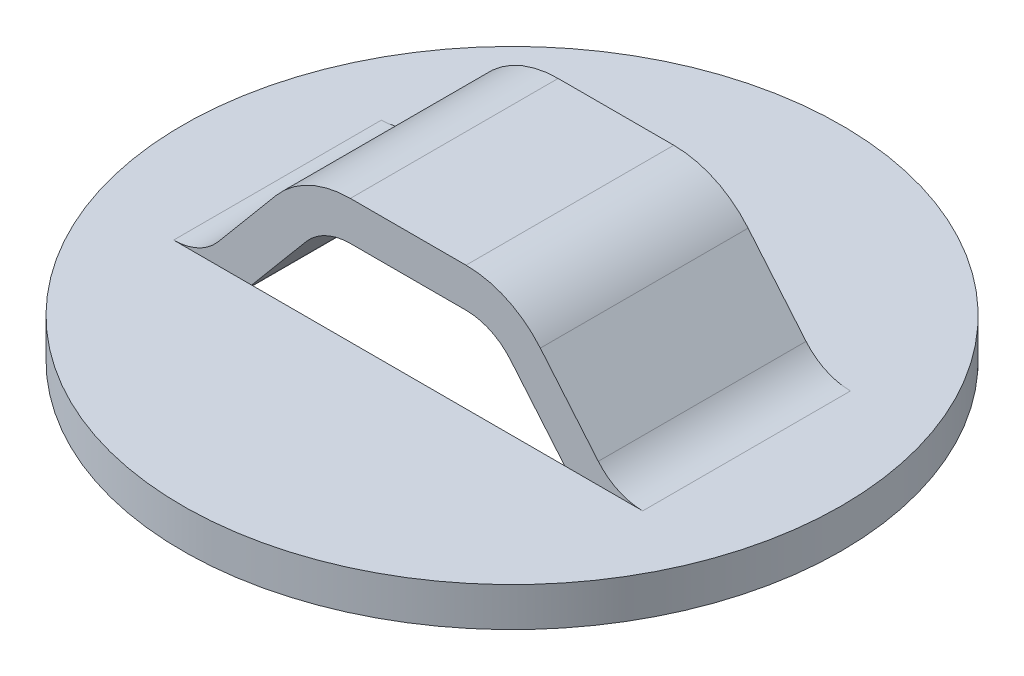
ISO-10303-21;
HEADER;
FILE_DESCRIPTION(('STEP AP214'),'2;1');
FILE_NAME('part.step','',(''),(''),'','','');
FILE_SCHEMA(('AUTOMOTIVE_DESIGN { 1 0 10303 214 1 1 1 1 }'));
ENDSEC;
DATA;
#1=APPLICATION_CONTEXT('core data for automotive mechanical design processes');
#2=APPLICATION_PROTOCOL_DEFINITION('international standard','automotive_design',2000,#1);
#3=PRODUCT_CONTEXT('',#1,'mechanical');
#4=PRODUCT('Part','Part','',(#3));
#5=PRODUCT_RELATED_PRODUCT_CATEGORY('part','',(#4));
#6=PRODUCT_DEFINITION_FORMATION('','',#4);
#7=PRODUCT_DEFINITION_CONTEXT('part definition',#1,'design');
#8=PRODUCT_DEFINITION('design','',#6,#7);
#9=PRODUCT_DEFINITION_SHAPE('','',#8);
#10=(LENGTH_UNIT() NAMED_UNIT(*) SI_UNIT(.MILLI.,.METRE.));
#11=(NAMED_UNIT(*) PLANE_ANGLE_UNIT() SI_UNIT($,.RADIAN.));
#12=(NAMED_UNIT(*) SI_UNIT($,.STERADIAN.) SOLID_ANGLE_UNIT());
#13=UNCERTAINTY_MEASURE_WITH_UNIT(LENGTH_MEASURE(1.E-05),#10,'distance_accuracy_value','');
#14=(GEOMETRIC_REPRESENTATION_CONTEXT(3) GLOBAL_UNCERTAINTY_ASSIGNED_CONTEXT((#13)) GLOBAL_UNIT_ASSIGNED_CONTEXT((#10,
#11,#12)) REPRESENTATION_CONTEXT('',''));
#15=CARTESIAN_POINT('',(0.,0.,0.));
#16=DIRECTION('',(0.,0.,1.));
#17=DIRECTION('',(1.,0.,0.));
#18=AXIS2_PLACEMENT_3D('',#15,#16,#17);
#19=CARTESIAN_POINT('',(-11.2977635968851,2.794,0.));
#20=DIRECTION('',(0.,0.,-1.));
#21=DIRECTION('',(-1.,0.,0.));
#22=AXIS2_PLACEMENT_3D('',#19,#20,#21);
#23=PLANE('',#22);
#24=DIRECTION('',(-1.,0.,0.));
#25=VECTOR('',#24,1.);
#26=CARTESIAN_POINT('',(-11.2977635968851,0.,0.));
#27=LINE('',#26,#25);
#28=CARTESIAN_POINT('',(11.2977635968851,0.,0.));
#29=VERTEX_POINT('',#28);
#30=CARTESIAN_POINT('',(7.54125645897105,0.,0.));
#31=VERTEX_POINT('',#30);
#32=EDGE_CURVE('E53',#29,#31,#27,.T.);
#33=ORIENTED_EDGE('',*,*,#32,.F.);
#34=CARTESIAN_POINT('',(11.2977635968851,2.794,0.));
#35=DIRECTION('',(0.,0.,1.));
#36=DIRECTION('',(1.,0.,0.));
#37=AXIS2_PLACEMENT_3D('',#34,#35,#36);
#38=CIRCLE('',#37,2.794);
#39=CARTESIAN_POINT('',(9.15743542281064,0.998051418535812,0.));
#40=VERTEX_POINT('',#39);
#41=EDGE_CURVE('E165',#29,#40,#38,.F.);
#42=ORIENTED_EDGE('',*,*,#41,.T.);
#43=DIRECTION('',(-0.642787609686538,0.76604444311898,0.));
#44=VECTOR('',#43,1.);
#45=CARTESIAN_POINT('',(6.36585100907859,4.324932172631,0.));
#46=LINE('',#45,#44);
#47=CARTESIAN_POINT('',(6.36585100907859,4.324932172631,0.));
#48=VERTEX_POINT('',#47);
#49=EDGE_CURVE('E196',#48,#40,#46,.F.);
#50=ORIENTED_EDGE('',*,*,#49,.F.);
#51=CARTESIAN_POINT('',(2.78566569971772,1.3208,0.));
#52=DIRECTION('',(0.,0.,1.));
#53=DIRECTION('',(1.,0.,0.));
#54=AXIS2_PLACEMENT_3D('',#51,#52,#53);
#55=CIRCLE('',#54,4.6736);
#56=CARTESIAN_POINT('',(2.78566569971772,5.9944,0.));
#57=VERTEX_POINT('',#56);
#58=EDGE_CURVE('E200',#57,#48,#55,.F.);
#59=ORIENTED_EDGE('',*,*,#58,.F.);
#60=DIRECTION('',(1.,0.,0.));
#61=VECTOR('',#60,1.);
#62=CARTESIAN_POINT('',(-2.78566569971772,5.9944,0.));
#63=LINE('',#62,#61);
#64=CARTESIAN_POINT('',(-2.78566569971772,5.9944,0.));
#65=VERTEX_POINT('',#64);
#66=EDGE_CURVE('E204',#65,#57,#63,.T.);
#67=ORIENTED_EDGE('',*,*,#66,.F.);
#68=CARTESIAN_POINT('',(-2.78566569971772,1.3208,0.));
#69=DIRECTION('',(0.,0.,1.));
#70=DIRECTION('',(1.,0.,0.));
#71=AXIS2_PLACEMENT_3D('',#68,#69,#70);
#72=CIRCLE('',#71,4.6736);
#73=CARTESIAN_POINT('',(-6.36585100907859,4.324932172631,0.));
#74=VERTEX_POINT('',#73);
#75=EDGE_CURVE('E208',#74,#65,#72,.F.);
#76=ORIENTED_EDGE('',*,*,#75,.F.);
#77=DIRECTION('',(-0.642787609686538,-0.76604444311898,0.));
#78=VECTOR('',#77,1.);
#79=CARTESIAN_POINT('',(-9.15743542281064,0.998051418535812,0.));
#80=LINE('',#79,#78);
#81=CARTESIAN_POINT('',(-9.15743542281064,0.998051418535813,0.));
#82=VERTEX_POINT('',#81);
#83=EDGE_CURVE('E212',#82,#74,#80,.F.);
#84=ORIENTED_EDGE('',*,*,#83,.F.);
#85=CARTESIAN_POINT('',(-11.2977635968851,2.794,0.));
#86=DIRECTION('',(0.,0.,1.));
#87=DIRECTION('',(1.,0.,0.));
#88=AXIS2_PLACEMENT_3D('',#85,#86,#87);
#89=CIRCLE('',#88,2.794);
#90=CARTESIAN_POINT('',(-11.2977635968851,0.,0.));
#91=VERTEX_POINT('',#90);
#92=EDGE_CURVE('E216',#82,#91,#89,.F.);
#93=ORIENTED_EDGE('',*,*,#92,.T.);
#94=CARTESIAN_POINT('',(-7.54125645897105,0.,0.));
#95=VERTEX_POINT('',#94);
#96=EDGE_CURVE('E173',#95,#91,#27,.T.);
#97=ORIENTED_EDGE('',*,*,#96,.F.);
#98=DIRECTION('',(0.642787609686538,0.766044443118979,0.));
#99=VECTOR('',#98,1.);
#100=CARTESIAN_POINT('',(-7.71757828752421,-0.210132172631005,0.));
#101=LINE('',#100,#99);
#102=CARTESIAN_POINT('',(-4.92599387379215,3.11674858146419,0.));
#103=VERTEX_POINT('',#102);
#104=EDGE_CURVE('E218',#103,#95,#101,.F.);
#105=ORIENTED_EDGE('',*,*,#104,.F.);
#106=CARTESIAN_POINT('',(-2.78566569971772,1.3208,0.));
#107=DIRECTION('',(0.,0.,1.));
#108=DIRECTION('',(1.,0.,0.));
#109=AXIS2_PLACEMENT_3D('',#106,#107,#108);
#110=CIRCLE('',#109,2.794);
#111=CARTESIAN_POINT('',(-2.78566569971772,4.1148,0.));
#112=VERTEX_POINT('',#111);
#113=EDGE_CURVE('E222',#103,#112,#110,.F.);
#114=ORIENTED_EDGE('',*,*,#113,.T.);
#115=DIRECTION('',(1.,0.,0.));
#116=VECTOR('',#115,1.);
#117=CARTESIAN_POINT('',(-2.78566569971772,4.1148,0.));
#118=LINE('',#117,#116);
#119=CARTESIAN_POINT('',(2.78566569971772,4.1148,0.));
#120=VERTEX_POINT('',#119);
#121=EDGE_CURVE('E223',#120,#112,#118,.F.);
#122=ORIENTED_EDGE('',*,*,#121,.F.);
#123=CARTESIAN_POINT('',(2.78566569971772,1.3208,0.));
#124=DIRECTION('',(0.,0.,1.));
#125=DIRECTION('',(1.,0.,0.));
#126=AXIS2_PLACEMENT_3D('',#123,#124,#125);
#127=CIRCLE('',#126,2.794);
#128=CARTESIAN_POINT('',(4.92599387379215,3.11674858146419,0.));
#129=VERTEX_POINT('',#128);
#130=EDGE_CURVE('E226',#120,#129,#127,.F.);
#131=ORIENTED_EDGE('',*,*,#130,.T.);
#132=DIRECTION('',(0.642787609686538,-0.766044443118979,0.));
#133=VECTOR('',#132,1.);
#134=CARTESIAN_POINT('',(4.92599387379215,3.11674858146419,0.));
#135=LINE('',#134,#133);
#136=EDGE_CURVE('E168',#31,#129,#135,.F.);
#137=ORIENTED_EDGE('',*,*,#136,.F.);
#138=EDGE_LOOP('',(#33,#42,#50,#59,#67,#76,#84,#93,#97,#105,#114,#122,#131,#137));
#139=FACE_BOUND('',#138,.T.);
#140=ADVANCED_FACE('F39',(#139),#23,.F.);
#141=CARTESIAN_POINT('',(-11.2977635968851,2.794,-10.0076));
#142=DIRECTION('',(0.,0.,-1.));
#143=DIRECTION('',(-1.,0.,0.));
#144=AXIS2_PLACEMENT_3D('',#141,#142,#143);
#145=PLANE('',#144);
#146=CARTESIAN_POINT('',(11.2977635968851,2.794,-10.0076));
#147=DIRECTION('',(0.,0.,1.));
#148=DIRECTION('',(1.,0.,0.));
#149=AXIS2_PLACEMENT_3D('',#146,#147,#148);
#150=CIRCLE('',#149,2.794);
#151=CARTESIAN_POINT('',(9.15743542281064,0.998051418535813,-10.0076));
#152=VERTEX_POINT('',#151);
#153=CARTESIAN_POINT('',(11.2977635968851,0.,-10.0076));
#154=VERTEX_POINT('',#153);
#155=EDGE_CURVE('E250',#152,#154,#150,.T.);
#156=ORIENTED_EDGE('',*,*,#155,.T.);
#157=DIRECTION('',(-1.,0.,0.));
#158=VECTOR('',#157,1.);
#159=CARTESIAN_POINT('',(-11.2977635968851,0.,-10.0076));
#160=LINE('',#159,#158);
#161=CARTESIAN_POINT('',(7.54125645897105,0.,-10.0076));
#162=VERTEX_POINT('',#161);
#163=EDGE_CURVE('E11',#154,#162,#160,.T.);
#164=ORIENTED_EDGE('',*,*,#163,.T.);
#165=DIRECTION('',(-0.642787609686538,0.766044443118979,0.));
#166=VECTOR('',#165,1.);
#167=CARTESIAN_POINT('',(7.7175782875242,-0.210132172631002,-10.0076));
#168=LINE('',#167,#166);
#169=CARTESIAN_POINT('',(4.92599387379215,3.11674858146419,-10.0076));
#170=VERTEX_POINT('',#169);
#171=EDGE_CURVE('E249',#162,#170,#168,.T.);
#172=ORIENTED_EDGE('',*,*,#171,.T.);
#173=CARTESIAN_POINT('',(2.78566569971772,1.3208,-10.0076));
#174=DIRECTION('',(0.,0.,1.));
#175=DIRECTION('',(1.,0.,0.));
#176=AXIS2_PLACEMENT_3D('',#173,#174,#175);
#177=CIRCLE('',#176,2.794);
#178=CARTESIAN_POINT('',(2.78566569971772,4.1148,-10.0076));
#179=VERTEX_POINT('',#178);
#180=EDGE_CURVE('E242',#170,#179,#177,.T.);
#181=ORIENTED_EDGE('',*,*,#180,.T.);
#182=DIRECTION('',(-1.,0.,0.));
#183=VECTOR('',#182,1.);
#184=CARTESIAN_POINT('',(-11.2977635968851,4.1148,-10.0076));
#185=LINE('',#184,#183);
#186=CARTESIAN_POINT('',(-2.78566569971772,4.1148,-10.0076));
#187=VERTEX_POINT('',#186);
#188=EDGE_CURVE('E241',#179,#187,#185,.T.);
#189=ORIENTED_EDGE('',*,*,#188,.T.);
#190=CARTESIAN_POINT('',(-2.78566569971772,1.3208,-10.0076));
#191=DIRECTION('',(0.,0.,1.));
#192=DIRECTION('',(1.,0.,0.));
#193=AXIS2_PLACEMENT_3D('',#190,#191,#192);
#194=CIRCLE('',#193,2.794);
#195=CARTESIAN_POINT('',(-4.92599387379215,3.11674858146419,-10.0076));
#196=VERTEX_POINT('',#195);
#197=EDGE_CURVE('E238',#187,#196,#194,.T.);
#198=ORIENTED_EDGE('',*,*,#197,.T.);
#199=DIRECTION('',(-0.642787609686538,-0.766044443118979,0.));
#200=VECTOR('',#199,1.);
#201=CARTESIAN_POINT('',(-4.92599387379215,3.11674858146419,-10.0076));
#202=LINE('',#201,#200);
#203=CARTESIAN_POINT('',(-7.54125645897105,0.,-10.0076));
#204=VERTEX_POINT('',#203);
#205=EDGE_CURVE('E237',#196,#204,#202,.T.);
#206=ORIENTED_EDGE('',*,*,#205,.T.);
#207=DIRECTION('',(1.,0.,0.));
#208=VECTOR('',#207,1.);
#209=CARTESIAN_POINT('',(-11.2977635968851,0.,-10.0076));
#210=LINE('',#209,#208);
#211=CARTESIAN_POINT('',(-11.2977635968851,0.,-10.0076));
#212=VERTEX_POINT('',#211);
#213=EDGE_CURVE('E285',#212,#204,#210,.T.);
#214=ORIENTED_EDGE('',*,*,#213,.F.);
#215=CARTESIAN_POINT('',(-11.2977635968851,2.794,-10.0076));
#216=DIRECTION('',(0.,0.,1.));
#217=DIRECTION('',(1.,0.,0.));
#218=AXIS2_PLACEMENT_3D('',#215,#216,#217);
#219=CIRCLE('',#218,2.794);
#220=CARTESIAN_POINT('',(-9.15743542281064,0.998051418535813,-10.0076));
#221=VERTEX_POINT('',#220);
#222=EDGE_CURVE('E261',#212,#221,#219,.T.);
#223=ORIENTED_EDGE('',*,*,#222,.T.);
#224=DIRECTION('',(0.642787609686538,0.766044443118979,0.));
#225=VECTOR('',#224,1.);
#226=CARTESIAN_POINT('',(-9.15743542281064,0.998051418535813,-10.0076));
#227=LINE('',#226,#225);
#228=CARTESIAN_POINT('',(-6.36585100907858,4.324932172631,-10.0076));
#229=VERTEX_POINT('',#228);
#230=EDGE_CURVE('E260',#221,#229,#227,.T.);
#231=ORIENTED_EDGE('',*,*,#230,.T.);
#232=CARTESIAN_POINT('',(-2.78566569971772,1.3208,-10.0076));
#233=DIRECTION('',(0.,0.,1.));
#234=DIRECTION('',(1.,0.,0.));
#235=AXIS2_PLACEMENT_3D('',#232,#233,#234);
#236=CIRCLE('',#235,4.6736);
#237=CARTESIAN_POINT('',(-2.78566569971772,5.9944,-10.0076));
#238=VERTEX_POINT('',#237);
#239=EDGE_CURVE('E257',#229,#238,#236,.F.);
#240=ORIENTED_EDGE('',*,*,#239,.T.);
#241=DIRECTION('',(-1.,0.,0.));
#242=VECTOR('',#241,1.);
#243=CARTESIAN_POINT('',(-11.2977635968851,5.9944,-10.0076));
#244=LINE('',#243,#242);
#245=CARTESIAN_POINT('',(2.78566569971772,5.9944,-10.0076));
#246=VERTEX_POINT('',#245);
#247=EDGE_CURVE('E256',#238,#246,#244,.F.);
#248=ORIENTED_EDGE('',*,*,#247,.T.);
#249=CARTESIAN_POINT('',(2.78566569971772,1.3208,-10.0076));
#250=DIRECTION('',(0.,0.,1.));
#251=DIRECTION('',(1.,0.,0.));
#252=AXIS2_PLACEMENT_3D('',#249,#250,#251);
#253=CIRCLE('',#252,4.6736);
#254=CARTESIAN_POINT('',(6.36585100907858,4.324932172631,-10.0076));
#255=VERTEX_POINT('',#254);
#256=EDGE_CURVE('E253',#246,#255,#253,.F.);
#257=ORIENTED_EDGE('',*,*,#256,.T.);
#258=DIRECTION('',(0.642787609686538,-0.766044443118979,0.));
#259=VECTOR('',#258,1.);
#260=CARTESIAN_POINT('',(6.36585100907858,4.324932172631,-10.0076));
#261=LINE('',#260,#259);
#262=EDGE_CURVE('E252',#255,#152,#261,.T.);
#263=ORIENTED_EDGE('',*,*,#262,.T.);
#264=EDGE_LOOP('',(#156,#164,#172,#181,#189,#198,#206,#214,#223,#231,#240,#248,#257,#263));
#265=FACE_BOUND('',#264,.T.);
#266=ADVANCED_FACE('F355',(#265),#145,.T.);
#267=CARTESIAN_POINT('',(-11.2977635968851,2.794,-10.0076));
#268=DIRECTION('',(0.,0.,1.));
#269=DIRECTION('',(1.,0.,0.));
#270=AXIS2_PLACEMENT_3D('',#267,#268,#269);
#271=CYLINDRICAL_SURFACE('',#270,2.794);
#272=DIRECTION('',(0.,0.,1.));
#273=VECTOR('',#272,1.);
#274=CARTESIAN_POINT('',(-9.15743542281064,0.998051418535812,-10.0076));
#275=LINE('',#274,#273);
#276=EDGE_CURVE('E209',#221,#82,#275,.T.);
#277=ORIENTED_EDGE('',*,*,#276,.F.);
#278=ORIENTED_EDGE('',*,*,#222,.F.);
#279=DIRECTION('',(0.,0.,1.));
#280=VECTOR('',#279,1.);
#281=CARTESIAN_POINT('',(-11.2977635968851,0.,-10.0076));
#282=LINE('',#281,#280);
#283=EDGE_CURVE('E213',#91,#212,#282,.F.);
#284=ORIENTED_EDGE('',*,*,#283,.F.);
#285=ORIENTED_EDGE('',*,*,#92,.F.);
#286=EDGE_LOOP('',(#277,#278,#284,#285));
#287=FACE_BOUND('',#286,.T.);
#288=ADVANCED_FACE('F283',(#287),#271,.F.);
#289=CARTESIAN_POINT('',(-9.15743542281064,0.998051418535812,-10.0076));
#290=DIRECTION('',(-0.76604444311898,0.642787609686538,0.));
#291=DIRECTION('',(-0.642787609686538,-0.76604444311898,0.));
#292=AXIS2_PLACEMENT_3D('',#289,#290,#291);
#293=PLANE('',#292);
#294=ORIENTED_EDGE('',*,*,#230,.F.);
#295=ORIENTED_EDGE('',*,*,#276,.T.);
#296=ORIENTED_EDGE('',*,*,#83,.T.);
#297=DIRECTION('',(0.,0.,1.));
#298=VECTOR('',#297,1.);
#299=CARTESIAN_POINT('',(-6.36585100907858,4.324932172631,-10.0076));
#300=LINE('',#299,#298);
#301=EDGE_CURVE('E205',#229,#74,#300,.T.);
#302=ORIENTED_EDGE('',*,*,#301,.F.);
#303=EDGE_LOOP('',(#294,#295,#296,#302));
#304=FACE_BOUND('',#303,.T.);
#305=ADVANCED_FACE('F364',(#304),#293,.T.);
#306=CARTESIAN_POINT('',(-2.78566569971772,1.3208,-10.0076));
#307=DIRECTION('',(0.,0.,1.));
#308=DIRECTION('',(1.,0.,0.));
#309=AXIS2_PLACEMENT_3D('',#306,#307,#308);
#310=CYLINDRICAL_SURFACE('',#309,4.6736);
#311=ORIENTED_EDGE('',*,*,#239,.F.);
#312=ORIENTED_EDGE('',*,*,#301,.T.);
#313=ORIENTED_EDGE('',*,*,#75,.T.);
#314=DIRECTION('',(0.,0.,1.));
#315=VECTOR('',#314,1.);
#316=CARTESIAN_POINT('',(-2.78566569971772,5.9944,-10.0076));
#317=LINE('',#316,#315);
#318=EDGE_CURVE('E201',#238,#65,#317,.T.);
#319=ORIENTED_EDGE('',*,*,#318,.F.);
#320=EDGE_LOOP('',(#311,#312,#313,#319));
#321=FACE_BOUND('',#320,.T.);
#322=ADVANCED_FACE('F407',(#321),#310,.T.);
#323=CARTESIAN_POINT('',(-2.78566569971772,5.9944,-10.0076));
#324=DIRECTION('',(0.,1.,0.));
#325=DIRECTION('',(0.,0.,1.));
#326=AXIS2_PLACEMENT_3D('',#323,#324,#325);
#327=PLANE('',#326);
#328=ORIENTED_EDGE('',*,*,#247,.F.);
#329=ORIENTED_EDGE('',*,*,#318,.T.);
#330=ORIENTED_EDGE('',*,*,#66,.T.);
#331=DIRECTION('',(0.,0.,1.));
#332=VECTOR('',#331,1.);
#333=CARTESIAN_POINT('',(2.78566569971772,5.9944,-10.0076));
#334=LINE('',#333,#332);
#335=EDGE_CURVE('E197',#246,#57,#334,.T.);
#336=ORIENTED_EDGE('',*,*,#335,.F.);
#337=EDGE_LOOP('',(#328,#329,#330,#336));
#338=FACE_BOUND('',#337,.T.);
#339=ADVANCED_FACE('F403',(#338),#327,.T.);
#340=CARTESIAN_POINT('',(2.78566569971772,1.3208,-10.0076));
#341=DIRECTION('',(0.,0.,1.));
#342=DIRECTION('',(1.,0.,0.));
#343=AXIS2_PLACEMENT_3D('',#340,#341,#342);
#344=CYLINDRICAL_SURFACE('',#343,4.6736);
#345=ORIENTED_EDGE('',*,*,#256,.F.);
#346=ORIENTED_EDGE('',*,*,#335,.T.);
#347=ORIENTED_EDGE('',*,*,#58,.T.);
#348=DIRECTION('',(0.,0.,1.));
#349=VECTOR('',#348,1.);
#350=CARTESIAN_POINT('',(6.36585100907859,4.324932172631,-10.0076));
#351=LINE('',#350,#349);
#352=EDGE_CURVE('E193',#255,#48,#351,.T.);
#353=ORIENTED_EDGE('',*,*,#352,.F.);
#354=EDGE_LOOP('',(#345,#346,#347,#353));
#355=FACE_BOUND('',#354,.T.);
#356=ADVANCED_FACE('F399',(#355),#344,.T.);
#357=CARTESIAN_POINT('',(6.36585100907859,4.324932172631,-10.0076));
#358=DIRECTION('',(0.76604444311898,0.642787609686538,0.));
#359=DIRECTION('',(-0.642787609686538,0.76604444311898,0.));
#360=AXIS2_PLACEMENT_3D('',#357,#358,#359);
#361=PLANE('',#360);
#362=ORIENTED_EDGE('',*,*,#262,.F.);
#363=ORIENTED_EDGE('',*,*,#352,.T.);
#364=ORIENTED_EDGE('',*,*,#49,.T.);
#365=DIRECTION('',(0.,0.,1.));
#366=VECTOR('',#365,1.);
#367=CARTESIAN_POINT('',(9.15743542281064,0.998051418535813,-10.0076));
#368=LINE('',#367,#366);
#369=EDGE_CURVE('E179',#40,#152,#368,.F.);
#370=ORIENTED_EDGE('',*,*,#369,.T.);
#371=EDGE_LOOP('',(#362,#363,#364,#370));
#372=FACE_BOUND('',#371,.T.);
#373=ADVANCED_FACE('F396',(#372),#361,.T.);
#374=CARTESIAN_POINT('',(11.2977635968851,2.794,-10.0076));
#375=DIRECTION('',(0.,0.,1.));
#376=DIRECTION('',(1.,0.,0.));
#377=AXIS2_PLACEMENT_3D('',#374,#375,#376);
#378=CYLINDRICAL_SURFACE('',#377,2.794);
#379=DIRECTION('',(0.,0.,1.));
#380=VECTOR('',#379,1.);
#381=CARTESIAN_POINT('',(11.2977635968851,0.,-10.0076));
#382=LINE('',#381,#380);
#383=EDGE_CURVE('E177',#154,#29,#382,.T.);
#384=ORIENTED_EDGE('',*,*,#383,.F.);
#385=ORIENTED_EDGE('',*,*,#155,.F.);
#386=ORIENTED_EDGE('',*,*,#369,.F.);
#387=ORIENTED_EDGE('',*,*,#41,.F.);
#388=EDGE_LOOP('',(#384,#385,#386,#387));
#389=FACE_BOUND('',#388,.T.);
#390=ADVANCED_FACE('F175',(#389),#378,.F.);
#391=CARTESIAN_POINT('',(11.2977635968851,0.,-10.0076));
#392=DIRECTION('',(0.,1.,0.));
#393=DIRECTION('',(0.,0.,1.));
#394=AXIS2_PLACEMENT_3D('',#391,#392,#393);
#395=PLANE('',#394);
#396=CARTESIAN_POINT('',(0.,0.,-5.0038));
#397=DIRECTION('',(0.,-1.,0.));
#398=DIRECTION('',(1.,0.,0.));
#399=AXIS2_PLACEMENT_3D('',#396,#397,#398);
#400=CIRCLE('',#399,15.875);
#401=CARTESIAN_POINT('',(15.875,0.,-5.0038));
#402=VERTEX_POINT('',#401);
#403=EDGE_CURVE('E294',#402,#402,#400,.T.);
#404=ORIENTED_EDGE('',*,*,#403,.F.);
#405=EDGE_LOOP('',(#404));
#406=FACE_BOUND('',#405,.T.);
#407=ORIENTED_EDGE('',*,*,#383,.T.);
#408=ORIENTED_EDGE('',*,*,#32,.T.);
#409=EDGE_CURVE('E171',#31,#95,#27,.T.);
#410=ORIENTED_EDGE('',*,*,#409,.T.);
#411=ORIENTED_EDGE('',*,*,#96,.T.);
#412=ORIENTED_EDGE('',*,*,#283,.T.);
#413=ORIENTED_EDGE('',*,*,#213,.T.);
#414=EDGE_CURVE('E170',#204,#162,#210,.T.);
#415=ORIENTED_EDGE('',*,*,#414,.T.);
#416=ORIENTED_EDGE('',*,*,#163,.F.);
#417=EDGE_LOOP('',(#407,#408,#410,#411,#412,#413,#415,#416));
#418=FACE_BOUND('',#417,.T.);
#419=ADVANCED_FACE('F182',(#406,#418),#395,.T.);
#420=CARTESIAN_POINT('',(11.2977635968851,2.794,-10.0076));
#421=DIRECTION('',(0.,0.,1.));
#422=DIRECTION('',(1.,0.,0.));
#423=AXIS2_PLACEMENT_3D('',#420,#421,#422);
#424=CYLINDRICAL_SURFACE('',#423,4.6736);
#425=CARTESIAN_POINT('',(11.2977635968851,2.794,-10.0076));
#426=DIRECTION('',(0.,0.,1.));
#427=DIRECTION('',(1.,0.,0.));
#428=AXIS2_PLACEMENT_3D('',#425,#426,#427);
#429=CIRCLE('',#428,4.6736);
#430=CARTESIAN_POINT('',(11.2977635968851,-1.8796,-10.0076));
#431=VERTEX_POINT('',#430);
#432=CARTESIAN_POINT('',(7.71757828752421,-0.210132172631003,-10.0076));
#433=VERTEX_POINT('',#432);
#434=EDGE_CURVE('E246',#431,#433,#429,.F.);
#435=ORIENTED_EDGE('',*,*,#434,.F.);
#436=DIRECTION('',(0.,0.,1.));
#437=VECTOR('',#436,1.);
#438=CARTESIAN_POINT('',(11.2977635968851,-1.8796,-10.0076));
#439=LINE('',#438,#437);
#440=CARTESIAN_POINT('',(11.2977635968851,-1.8796,0.));
#441=VERTEX_POINT('',#440);
#442=EDGE_CURVE('E187',#431,#441,#439,.T.);
#443=ORIENTED_EDGE('',*,*,#442,.T.);
#444=CARTESIAN_POINT('',(11.2977635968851,2.794,0.));
#445=DIRECTION('',(0.,0.,1.));
#446=DIRECTION('',(1.,0.,0.));
#447=AXIS2_PLACEMENT_3D('',#444,#445,#446);
#448=CIRCLE('',#447,4.6736);
#449=CARTESIAN_POINT('',(7.7175782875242,-0.210132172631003,0.));
#450=VERTEX_POINT('',#449);
#451=EDGE_CURVE('E184',#441,#450,#448,.F.);
#452=ORIENTED_EDGE('',*,*,#451,.T.);
#453=DIRECTION('',(0.,0.,1.));
#454=VECTOR('',#453,1.);
#455=CARTESIAN_POINT('',(7.7175782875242,-0.210132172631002,-10.0076));
#456=LINE('',#455,#454);
#457=EDGE_CURVE('E229',#433,#450,#456,.T.);
#458=ORIENTED_EDGE('',*,*,#457,.F.);
#459=EDGE_LOOP('',(#435,#443,#452,#458));
#460=FACE_BOUND('',#459,.T.);
#461=ADVANCED_FACE('F328',(#460),#424,.T.);
#462=CARTESIAN_POINT('',(4.92599387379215,3.11674858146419,-10.0076));
#463=DIRECTION('',(-0.766044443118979,-0.642787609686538,0.));
#464=DIRECTION('',(0.642787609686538,-0.766044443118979,0.));
#465=AXIS2_PLACEMENT_3D('',#462,#463,#464);
#466=PLANE('',#465);
#467=EDGE_CURVE('E245',#433,#162,#168,.T.);
#468=ORIENTED_EDGE('',*,*,#467,.F.);
#469=ORIENTED_EDGE('',*,*,#457,.T.);
#470=EDGE_CURVE('E227',#450,#31,#135,.F.);
#471=ORIENTED_EDGE('',*,*,#470,.T.);
#472=ORIENTED_EDGE('',*,*,#136,.T.);
#473=DIRECTION('',(0.,0.,1.));
#474=VECTOR('',#473,1.);
#475=CARTESIAN_POINT('',(4.92599387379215,3.11674858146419,-10.0076));
#476=LINE('',#475,#474);
#477=EDGE_CURVE('E272',#129,#170,#476,.F.);
#478=ORIENTED_EDGE('',*,*,#477,.T.);
#479=ORIENTED_EDGE('',*,*,#171,.F.);
#480=EDGE_LOOP('',(#468,#469,#471,#472,#478,#479));
#481=FACE_BOUND('',#480,.T.);
#482=ADVANCED_FACE('F325',(#481),#466,.T.);
#483=CARTESIAN_POINT('',(2.78566569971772,1.3208,-10.0076));
#484=DIRECTION('',(0.,0.,1.));
#485=DIRECTION('',(1.,0.,0.));
#486=AXIS2_PLACEMENT_3D('',#483,#484,#485);
#487=CYLINDRICAL_SURFACE('',#486,2.794);
#488=DIRECTION('',(0.,0.,-1.));
#489=VECTOR('',#488,1.);
#490=CARTESIAN_POINT('',(2.78566569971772,4.1148,-10.0076));
#491=LINE('',#490,#489);
#492=EDGE_CURVE('E225',#179,#120,#491,.F.);
#493=ORIENTED_EDGE('',*,*,#492,.F.);
#494=ORIENTED_EDGE('',*,*,#180,.F.);
#495=ORIENTED_EDGE('',*,*,#477,.F.);
#496=ORIENTED_EDGE('',*,*,#130,.F.);
#497=EDGE_LOOP('',(#493,#494,#495,#496));
#498=FACE_BOUND('',#497,.T.);
#499=ADVANCED_FACE('F382',(#498),#487,.F.);
#500=CARTESIAN_POINT('',(-2.78566569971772,4.1148,-10.0076));
#501=DIRECTION('',(0.,-1.,0.));
#502=DIRECTION('',(0.,0.,-1.));
#503=AXIS2_PLACEMENT_3D('',#500,#501,#502);
#504=PLANE('',#503);
#505=ORIENTED_EDGE('',*,*,#188,.F.);
#506=ORIENTED_EDGE('',*,*,#492,.T.);
#507=ORIENTED_EDGE('',*,*,#121,.T.);
#508=DIRECTION('',(0.,0.,1.));
#509=VECTOR('',#508,1.);
#510=CARTESIAN_POINT('',(-2.78566569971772,4.1148,-10.0076));
#511=LINE('',#510,#509);
#512=EDGE_CURVE('E271',#112,#187,#511,.F.);
#513=ORIENTED_EDGE('',*,*,#512,.T.);
#514=EDGE_LOOP('',(#505,#506,#507,#513));
#515=FACE_BOUND('',#514,.T.);
#516=ADVANCED_FACE('F378',(#515),#504,.T.);
#517=CARTESIAN_POINT('',(-2.78566569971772,1.3208,-10.0076));
#518=DIRECTION('',(0.,0.,1.));
#519=DIRECTION('',(1.,0.,0.));
#520=AXIS2_PLACEMENT_3D('',#517,#518,#519);
#521=CYLINDRICAL_SURFACE('',#520,2.794);
#522=DIRECTION('',(0.,0.,1.));
#523=VECTOR('',#522,1.);
#524=CARTESIAN_POINT('',(-4.92599387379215,3.11674858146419,-10.0076));
#525=LINE('',#524,#523);
#526=EDGE_CURVE('E221',#196,#103,#525,.T.);
#527=ORIENTED_EDGE('',*,*,#526,.F.);
#528=ORIENTED_EDGE('',*,*,#197,.F.);
#529=ORIENTED_EDGE('',*,*,#512,.F.);
#530=ORIENTED_EDGE('',*,*,#113,.F.);
#531=EDGE_LOOP('',(#527,#528,#529,#530));
#532=FACE_BOUND('',#531,.T.);
#533=ADVANCED_FACE('F375',(#532),#521,.F.);
#534=CARTESIAN_POINT('',(-7.71757828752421,-0.210132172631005,-10.0076));
#535=DIRECTION('',(0.766044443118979,-0.642787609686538,0.));
#536=DIRECTION('',(0.642787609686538,0.766044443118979,0.));
#537=AXIS2_PLACEMENT_3D('',#534,#535,#536);
#538=PLANE('',#537);
#539=ORIENTED_EDGE('',*,*,#205,.F.);
#540=ORIENTED_EDGE('',*,*,#526,.T.);
#541=ORIENTED_EDGE('',*,*,#104,.T.);
#542=DIRECTION('',(-0.642787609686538,-0.766044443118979,0.));
#543=VECTOR('',#542,1.);
#544=CARTESIAN_POINT('',(-7.71757828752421,-0.210132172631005,0.));
#545=LINE('',#544,#543);
#546=CARTESIAN_POINT('',(-7.71757828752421,-0.210132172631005,0.));
#547=VERTEX_POINT('',#546);
#548=EDGE_CURVE('E217',#95,#547,#545,.T.);
#549=ORIENTED_EDGE('',*,*,#548,.T.);
#550=DIRECTION('',(0.,0.,1.));
#551=VECTOR('',#550,1.);
#552=CARTESIAN_POINT('',(-7.71757828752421,-0.210132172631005,-10.0076));
#553=LINE('',#552,#551);
#554=CARTESIAN_POINT('',(-7.71757828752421,-0.210132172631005,-10.0076));
#555=VERTEX_POINT('',#554);
#556=EDGE_CURVE('E268',#555,#547,#553,.T.);
#557=ORIENTED_EDGE('',*,*,#556,.F.);
#558=EDGE_CURVE('E61',#204,#555,#202,.T.);
#559=ORIENTED_EDGE('',*,*,#558,.F.);
#560=EDGE_LOOP('',(#539,#540,#541,#549,#557,#559));
#561=FACE_BOUND('',#560,.T.);
#562=ADVANCED_FACE('F370',(#561),#538,.T.);
#563=CARTESIAN_POINT('',(-11.2977635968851,2.794,-10.0076));
#564=DIRECTION('',(0.,0.,1.));
#565=DIRECTION('',(1.,0.,0.));
#566=AXIS2_PLACEMENT_3D('',#563,#564,#565);
#567=CYLINDRICAL_SURFACE('',#566,4.6736);
#568=CARTESIAN_POINT('',(-11.2977635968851,2.794,-10.0076));
#569=DIRECTION('',(0.,0.,1.));
#570=DIRECTION('',(1.,0.,0.));
#571=AXIS2_PLACEMENT_3D('',#568,#569,#570);
#572=CIRCLE('',#571,4.6736);
#573=CARTESIAN_POINT('',(-11.2977635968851,-1.8796,-10.0076));
#574=VERTEX_POINT('',#573);
#575=EDGE_CURVE('E46',#555,#574,#572,.F.);
#576=ORIENTED_EDGE('',*,*,#575,.F.);
#577=ORIENTED_EDGE('',*,*,#556,.T.);
#578=CARTESIAN_POINT('',(-11.2977635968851,2.794,0.));
#579=DIRECTION('',(0.,0.,1.));
#580=DIRECTION('',(1.,0.,0.));
#581=AXIS2_PLACEMENT_3D('',#578,#579,#580);
#582=CIRCLE('',#581,4.6736);
#583=CARTESIAN_POINT('',(-11.2977635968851,-1.8796,0.));
#584=VERTEX_POINT('',#583);
#585=EDGE_CURVE('E265',#547,#584,#582,.F.);
#586=ORIENTED_EDGE('',*,*,#585,.T.);
#587=DIRECTION('',(0.,0.,-1.));
#588=VECTOR('',#587,1.);
#589=CARTESIAN_POINT('',(-11.2977635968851,-1.8796,-10.0076));
#590=LINE('',#589,#588);
#591=EDGE_CURVE('E264',#574,#584,#590,.F.);
#592=ORIENTED_EDGE('',*,*,#591,.F.);
#593=EDGE_LOOP('',(#576,#577,#586,#592));
#594=FACE_BOUND('',#593,.T.);
#595=ADVANCED_FACE('F340',(#594),#567,.T.);
#596=CARTESIAN_POINT('',(-15.875,-1.8796,-10.0076));
#597=DIRECTION('',(0.,-1.,0.));
#598=DIRECTION('',(0.,0.,-1.));
#599=AXIS2_PLACEMENT_3D('',#596,#597,#598);
#600=PLANE('',#599);
#601=DIRECTION('',(-1.,0.,0.));
#602=VECTOR('',#601,1.);
#603=CARTESIAN_POINT('',(-11.2977635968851,-1.8796,0.));
#604=LINE('',#603,#602);
#605=EDGE_CURVE('E288',#441,#584,#604,.T.);
#606=ORIENTED_EDGE('',*,*,#605,.F.);
#607=ORIENTED_EDGE('',*,*,#442,.F.);
#608=DIRECTION('',(1.,0.,0.));
#609=VECTOR('',#608,1.);
#610=CARTESIAN_POINT('',(-11.2977635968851,-1.8796,-10.0076));
#611=LINE('',#610,#609);
#612=EDGE_CURVE('E286',#574,#431,#611,.T.);
#613=ORIENTED_EDGE('',*,*,#612,.F.);
#614=ORIENTED_EDGE('',*,*,#591,.T.);
#615=EDGE_LOOP('',(#606,#607,#613,#614));
#616=FACE_BOUND('',#615,.T.);
#617=CARTESIAN_POINT('',(0.,-1.8796,-5.0038));
#618=DIRECTION('',(0.,-1.,0.));
#619=DIRECTION('',(1.,0.,0.));
#620=AXIS2_PLACEMENT_3D('',#617,#618,#619);
#621=CIRCLE('',#620,15.875);
#622=CARTESIAN_POINT('',(15.875,-1.8796,-5.0038));
#623=VERTEX_POINT('',#622);
#624=EDGE_CURVE('E292',#623,#623,#621,.T.);
#625=ORIENTED_EDGE('',*,*,#624,.T.);
#626=EDGE_LOOP('',(#625));
#627=FACE_BOUND('',#626,.T.);
#628=ADVANCED_FACE('F335',(#616,#627),#600,.T.);
#629=CARTESIAN_POINT('',(0.,0.,-5.0038));
#630=DIRECTION('',(0.,-1.,0.));
#631=DIRECTION('',(1.,0.,0.));
#632=AXIS2_PLACEMENT_3D('',#629,#630,#631);
#633=CYLINDRICAL_SURFACE('',#632,15.875);
#634=CARTESIAN_POINT('',(15.875,-1.8796,-5.0038));
#635=CARTESIAN_POINT('',(15.875,-1.86002083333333,-5.0038));
#636=CARTESIAN_POINT('',(15.875,-1.84044166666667,-5.0038));
#637=CARTESIAN_POINT('',(15.875,-1.80128333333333,-5.0038));
#638=CARTESIAN_POINT('',(15.875,-1.78170416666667,-5.0038));
#639=CARTESIAN_POINT('',(15.875,-1.74254583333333,-5.0038));
#640=CARTESIAN_POINT('',(15.875,-1.72296666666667,-5.0038));
#641=CARTESIAN_POINT('',(15.875,-1.68380833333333,-5.0038));
#642=CARTESIAN_POINT('',(15.875,-1.66422916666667,-5.0038));
#643=CARTESIAN_POINT('',(15.875,-1.62507083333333,-5.0038));
#644=CARTESIAN_POINT('',(15.875,-1.60549166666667,-5.0038));
#645=CARTESIAN_POINT('',(15.875,-1.56633333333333,-5.0038));
#646=CARTESIAN_POINT('',(15.875,-1.54675416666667,-5.0038));
#647=CARTESIAN_POINT('',(15.875,-1.50759583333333,-5.0038));
#648=CARTESIAN_POINT('',(15.875,-1.48801666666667,-5.0038));
#649=CARTESIAN_POINT('',(15.875,-1.44885833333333,-5.0038));
#650=CARTESIAN_POINT('',(15.875,-1.42927916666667,-5.0038));
#651=CARTESIAN_POINT('',(15.875,-1.39012083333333,-5.0038));
#652=CARTESIAN_POINT('',(15.875,-1.37054166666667,-5.0038));
#653=CARTESIAN_POINT('',(15.875,-1.33138333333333,-5.0038));
#654=CARTESIAN_POINT('',(15.875,-1.31180416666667,-5.0038));
#655=CARTESIAN_POINT('',(15.875,-1.27264583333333,-5.0038));
#656=CARTESIAN_POINT('',(15.875,-1.25306666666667,-5.0038));
#657=CARTESIAN_POINT('',(15.875,-1.21390833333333,-5.0038));
#658=CARTESIAN_POINT('',(15.875,-1.19432916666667,-5.0038));
#659=CARTESIAN_POINT('',(15.875,-1.15517083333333,-5.0038));
#660=CARTESIAN_POINT('',(15.875,-1.13559166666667,-5.0038));
#661=CARTESIAN_POINT('',(15.875,-1.09643333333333,-5.0038));
#662=CARTESIAN_POINT('',(15.875,-1.07685416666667,-5.0038));
#663=CARTESIAN_POINT('',(15.875,-1.03769583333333,-5.0038));
#664=CARTESIAN_POINT('',(15.875,-1.01811666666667,-5.0038));
#665=CARTESIAN_POINT('',(15.875,-0.978958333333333,-5.0038));
#666=CARTESIAN_POINT('',(15.875,-0.959379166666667,-5.0038));
#667=CARTESIAN_POINT('',(15.875,-0.920220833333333,-5.0038));
#668=CARTESIAN_POINT('',(15.875,-0.900641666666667,-5.0038));
#669=CARTESIAN_POINT('',(15.875,-0.861483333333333,-5.0038));
#670=CARTESIAN_POINT('',(15.875,-0.841904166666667,-5.0038));
#671=CARTESIAN_POINT('',(15.875,-0.802745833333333,-5.0038));
#672=CARTESIAN_POINT('',(15.875,-0.783166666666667,-5.0038));
#673=CARTESIAN_POINT('',(15.875,-0.744008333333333,-5.0038));
#674=CARTESIAN_POINT('',(15.875,-0.724429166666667,-5.0038));
#675=CARTESIAN_POINT('',(15.875,-0.685270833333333,-5.0038));
#676=CARTESIAN_POINT('',(15.875,-0.665691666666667,-5.0038));
#677=CARTESIAN_POINT('',(15.875,-0.626533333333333,-5.0038));
#678=CARTESIAN_POINT('',(15.875,-0.606954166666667,-5.0038));
#679=CARTESIAN_POINT('',(15.875,-0.567795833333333,-5.0038));
#680=CARTESIAN_POINT('',(15.875,-0.548216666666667,-5.0038));
#681=CARTESIAN_POINT('',(15.875,-0.509058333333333,-5.0038));
#682=CARTESIAN_POINT('',(15.875,-0.489479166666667,-5.0038));
#683=CARTESIAN_POINT('',(15.875,-0.450320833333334,-5.0038));
#684=CARTESIAN_POINT('',(15.875,-0.430741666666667,-5.0038));
#685=CARTESIAN_POINT('',(15.875,-0.391583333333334,-5.0038));
#686=CARTESIAN_POINT('',(15.875,-0.372004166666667,-5.0038));
#687=CARTESIAN_POINT('',(15.875,-0.332845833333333,-5.0038));
#688=CARTESIAN_POINT('',(15.875,-0.313266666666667,-5.0038));
#689=CARTESIAN_POINT('',(15.875,-0.274108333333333,-5.0038));
#690=CARTESIAN_POINT('',(15.875,-0.254529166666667,-5.0038));
#691=CARTESIAN_POINT('',(15.875,-0.215370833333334,-5.0038));
#692=CARTESIAN_POINT('',(15.875,-0.195791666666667,-5.0038));
#693=CARTESIAN_POINT('',(15.875,-0.156633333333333,-5.0038));
#694=CARTESIAN_POINT('',(15.875,-0.137054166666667,-5.0038));
#695=CARTESIAN_POINT('',(15.875,-0.0978958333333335,-5.0038));
#696=CARTESIAN_POINT('',(15.875,-0.0783166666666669,-5.0038));
#697=CARTESIAN_POINT('',(15.875,-0.0391583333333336,-5.0038));
#698=CARTESIAN_POINT('',(15.875,-0.0195791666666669,-5.0038));
#699=CARTESIAN_POINT('',(15.875,0.,-5.0038));
#700=B_SPLINE_CURVE_WITH_KNOTS('',3,(#634,#635,#636,#637,#638,#639,#640,#641,#642,#643,#644,
#645,#646,#647,#648,#649,#650,#651,#652,#653,#654,#655,#656,#657,#658,#659,#660,#661,#662,#663,
#664,#665,#666,#667,#668,#669,#670,#671,#672,#673,#674,#675,#676,#677,#678,#679,#680,#681,#682,
#683,#684,#685,#686,#687,#688,#689,#690,#691,#692,#693,#694,#695,#696,#697,#698,#699),
.UNSPECIFIED.,.F.,.F.,(4,2,2,2,2,2,2,2,2,2,2,2,2,2,2,2,2,2,2,2,2,2,2,2,2,2,2,2,2,2,2,2,4),(0.,
0.0587375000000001,0.117475,0.1762125,0.23495,0.2936875,0.352425,0.4111625,0.4699,0.5286375,
0.587375,0.6461125,0.70485,0.7635875,0.822325,0.8810625,0.9398,0.9985375,1.057275,1.1160125,
1.17475,1.2334875,1.292225,1.3509625,1.4097,1.4684375,1.527175,1.5859125,1.64465,1.7033875,
1.762125,1.8208625,1.8796),.UNSPECIFIED.);
#701=EDGE_CURVE('BSEAM345',#623,#402,#700,.T.);
#702=ORIENTED_EDGE('',*,*,#624,.F.);
#703=ORIENTED_EDGE('',*,*,#403,.T.);
#704=ORIENTED_EDGE('',*,*,#701,.T.);
#705=ORIENTED_EDGE('',*,*,#701,.F.);
#706=EDGE_LOOP('',(#702,#704,#703,#705));
#707=FACE_BOUND('',#706,.T.);
#708=ADVANCED_FACE('F345',(#707),#633,.T.);
#709=CARTESIAN_POINT('',(-11.2977635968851,0.,-10.0076));
#710=DIRECTION('',(0.,0.,-1.));
#711=DIRECTION('',(-1.,0.,0.));
#712=AXIS2_PLACEMENT_3D('',#709,#710,#711);
#713=PLANE('',#712);
#714=ORIENTED_EDGE('',*,*,#434,.T.);
#715=ORIENTED_EDGE('',*,*,#467,.T.);
#716=ORIENTED_EDGE('',*,*,#414,.F.);
#717=ORIENTED_EDGE('',*,*,#558,.T.);
#718=ORIENTED_EDGE('',*,*,#575,.T.);
#719=ORIENTED_EDGE('',*,*,#612,.T.);
#720=EDGE_LOOP('',(#714,#715,#716,#717,#718,#719));
#721=FACE_BOUND('',#720,.T.);
#722=ADVANCED_FACE('F342',(#721),#713,.F.);
#723=CARTESIAN_POINT('',(-11.2977635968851,0.,0.));
#724=DIRECTION('',(0.,0.,1.));
#725=DIRECTION('',(1.,0.,0.));
#726=AXIS2_PLACEMENT_3D('',#723,#724,#725);
#727=PLANE('',#726);
#728=ORIENTED_EDGE('',*,*,#451,.F.);
#729=ORIENTED_EDGE('',*,*,#605,.T.);
#730=ORIENTED_EDGE('',*,*,#585,.F.);
#731=ORIENTED_EDGE('',*,*,#548,.F.);
#732=ORIENTED_EDGE('',*,*,#409,.F.);
#733=ORIENTED_EDGE('',*,*,#470,.F.);
#734=EDGE_LOOP('',(#728,#729,#730,#731,#732,#733));
#735=FACE_BOUND('',#734,.T.);
#736=ADVANCED_FACE('F333',(#735),#727,.F.);
#737=CLOSED_SHELL('',(#140,#266,#288,#305,#322,#339,#356,#373,#390,#419,#461,#482,#499,#516,
#533,#562,#595,#628,#708,#722,#736));
#738=MANIFOLD_SOLID_BREP('B2',#737);
#739=ADVANCED_BREP_SHAPE_REPRESENTATION('',(#18,#738),#14);
#740=SHAPE_DEFINITION_REPRESENTATION(#9,#739);
ENDSEC;
END-ISO-10303-21;
